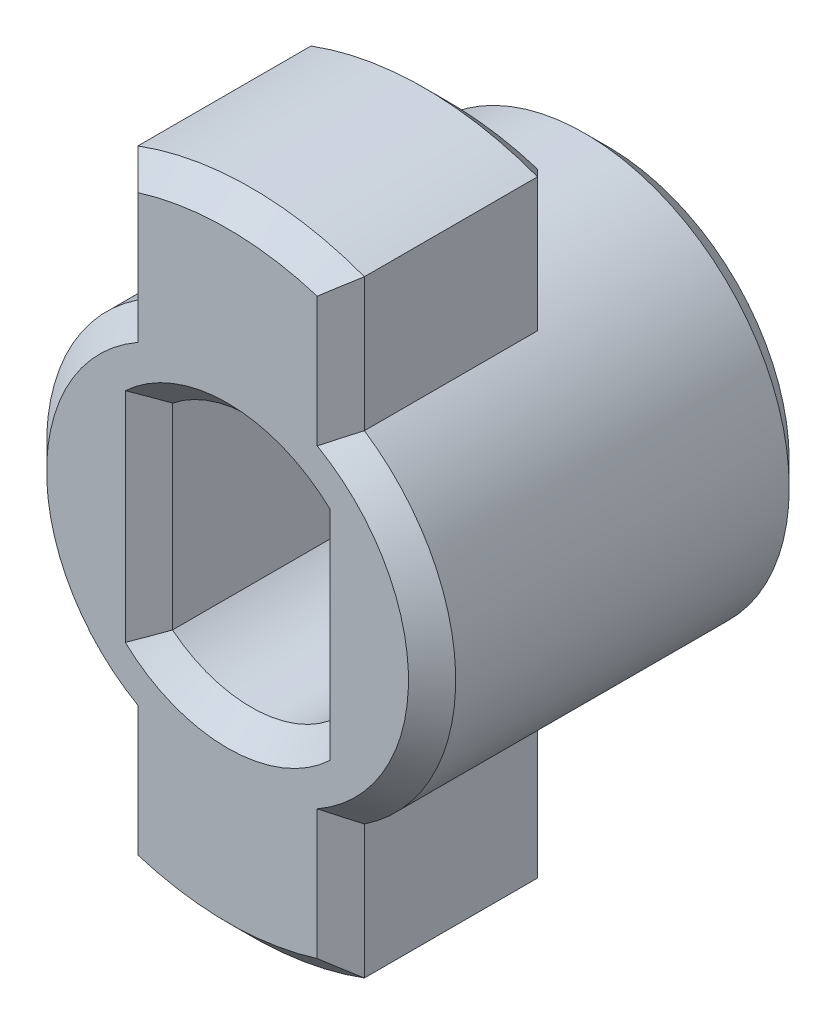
ISO-10303-21;
HEADER;
FILE_DESCRIPTION(('STEP AP214'),'2;1');
FILE_NAME('part.step','',(''),(''),'','','');
FILE_SCHEMA(('AUTOMOTIVE_DESIGN { 1 0 10303 214 1 1 1 1 }'));
ENDSEC;
DATA;
#1=APPLICATION_CONTEXT('core data for automotive mechanical design processes');
#2=APPLICATION_PROTOCOL_DEFINITION('international standard','automotive_design',2000,#1);
#3=PRODUCT_CONTEXT('',#1,'mechanical');
#4=PRODUCT('Part','Part','',(#3));
#5=PRODUCT_RELATED_PRODUCT_CATEGORY('part','',(#4));
#6=PRODUCT_DEFINITION_FORMATION('','',#4);
#7=PRODUCT_DEFINITION_CONTEXT('part definition',#1,'design');
#8=PRODUCT_DEFINITION('design','',#6,#7);
#9=PRODUCT_DEFINITION_SHAPE('','',#8);
#10=(LENGTH_UNIT() NAMED_UNIT(*) SI_UNIT(.MILLI.,.METRE.));
#11=(NAMED_UNIT(*) PLANE_ANGLE_UNIT() SI_UNIT($,.RADIAN.));
#12=(NAMED_UNIT(*) SI_UNIT($,.STERADIAN.) SOLID_ANGLE_UNIT());
#13=UNCERTAINTY_MEASURE_WITH_UNIT(LENGTH_MEASURE(1.E-05),#10,'distance_accuracy_value','');
#14=(GEOMETRIC_REPRESENTATION_CONTEXT(3) GLOBAL_UNCERTAINTY_ASSIGNED_CONTEXT((#13)) GLOBAL_UNIT_ASSIGNED_CONTEXT((#10,
#11,#12)) REPRESENTATION_CONTEXT('',''));
#15=CARTESIAN_POINT('',(0.,0.,0.));
#16=DIRECTION('',(0.,0.,1.));
#17=DIRECTION('',(1.,0.,0.));
#18=AXIS2_PLACEMENT_3D('',#15,#16,#17);
#19=CARTESIAN_POINT('',(0.,0.,12.1));
#20=DIRECTION('',(0.,0.,1.));
#21=DIRECTION('',(1.,0.,0.));
#22=AXIS2_PLACEMENT_3D('',#19,#20,#21);
#23=PLANE('',#22);
#24=DIRECTION('',(0.,-1.,0.));
#25=VECTOR('',#24,1.);
#26=CARTESIAN_POINT('',(3.25000000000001,0.,12.1));
#27=LINE('',#26,#25);
#28=CARTESIAN_POINT('',(3.25000000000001,3.46410161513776,12.1));
#29=VERTEX_POINT('',#28);
#30=CARTESIAN_POINT('',(3.25000000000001,-3.46410161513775,12.1));
#31=VERTEX_POINT('',#30);
#32=EDGE_CURVE('E264',#29,#31,#27,.T.);
#33=ORIENTED_EDGE('',*,*,#32,.T.);
#34=CARTESIAN_POINT('',(0.,0.,12.1));
#35=DIRECTION('',(0.,0.,1.));
#36=DIRECTION('',(1.,0.,0.));
#37=AXIS2_PLACEMENT_3D('',#34,#35,#36);
#38=CIRCLE('',#37,4.75000000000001);
#39=CARTESIAN_POINT('',(-3.25000000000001,-3.46410161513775,12.1));
#40=VERTEX_POINT('',#39);
#41=EDGE_CURVE('E266',#31,#40,#38,.F.);
#42=ORIENTED_EDGE('',*,*,#41,.T.);
#43=DIRECTION('',(0.,1.,0.));
#44=VECTOR('',#43,1.);
#45=CARTESIAN_POINT('',(-3.25000000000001,0.,12.1));
#46=LINE('',#45,#44);
#47=CARTESIAN_POINT('',(-3.25000000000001,3.46410161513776,12.1));
#48=VERTEX_POINT('',#47);
#49=EDGE_CURVE('E260',#40,#48,#46,.T.);
#50=ORIENTED_EDGE('',*,*,#49,.T.);
#51=CARTESIAN_POINT('',(0.,0.,12.1));
#52=DIRECTION('',(0.,0.,1.));
#53=DIRECTION('',(1.,0.,0.));
#54=AXIS2_PLACEMENT_3D('',#51,#52,#53);
#55=CIRCLE('',#54,4.75000000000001);
#56=EDGE_CURVE('E262',#48,#29,#55,.F.);
#57=ORIENTED_EDGE('',*,*,#56,.T.);
#58=EDGE_LOOP('',(#33,#42,#50,#57));
#59=FACE_BOUND('',#58,.T.);
#60=CARTESIAN_POINT('',(0.,0.,12.1));
#61=DIRECTION('',(0.,0.,1.));
#62=DIRECTION('',(1.,0.,0.));
#63=AXIS2_PLACEMENT_3D('',#60,#61,#62);
#64=CIRCLE('',#63,9.54999999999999);
#65=CARTESIAN_POINT('',(-2.84999999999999,-9.11482309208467,12.1));
#66=VERTEX_POINT('',#65);
#67=CARTESIAN_POINT('',(2.84999999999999,-9.11482309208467,12.1));
#68=VERTEX_POINT('',#67);
#69=EDGE_CURVE('E255',#66,#68,#64,.T.);
#70=ORIENTED_EDGE('',*,*,#69,.T.);
#71=DIRECTION('',(0.,1.,0.));
#72=VECTOR('',#71,1.);
#73=CARTESIAN_POINT('',(2.84999999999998,0.,12.1));
#74=LINE('',#73,#72);
#75=CARTESIAN_POINT('',(2.84999999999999,-4.9939963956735,12.1));
#76=VERTEX_POINT('',#75);
#77=EDGE_CURVE('E257',#68,#76,#74,.T.);
#78=ORIENTED_EDGE('',*,*,#77,.T.);
#79=CARTESIAN_POINT('',(0.,0.,12.1));
#80=DIRECTION('',(0.,0.,1.));
#81=DIRECTION('',(1.,0.,0.));
#82=AXIS2_PLACEMENT_3D('',#79,#80,#81);
#83=CIRCLE('',#82,5.74999999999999);
#84=CARTESIAN_POINT('',(2.84999999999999,4.9939963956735,12.1));
#85=VERTEX_POINT('',#84);
#86=EDGE_CURVE('E243',#76,#85,#83,.T.);
#87=ORIENTED_EDGE('',*,*,#86,.T.);
#88=DIRECTION('',(0.,1.,0.));
#89=VECTOR('',#88,1.);
#90=CARTESIAN_POINT('',(2.84999999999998,0.,12.1));
#91=LINE('',#90,#89);
#92=CARTESIAN_POINT('',(2.84999999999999,9.11482309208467,12.1));
#93=VERTEX_POINT('',#92);
#94=EDGE_CURVE('E245',#85,#93,#91,.T.);
#95=ORIENTED_EDGE('',*,*,#94,.T.);
#96=CARTESIAN_POINT('',(0.,0.,12.1));
#97=DIRECTION('',(0.,0.,1.));
#98=DIRECTION('',(1.,0.,0.));
#99=AXIS2_PLACEMENT_3D('',#96,#97,#98);
#100=CIRCLE('',#99,9.54999999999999);
#101=CARTESIAN_POINT('',(-2.84999999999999,9.11482309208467,12.1));
#102=VERTEX_POINT('',#101);
#103=EDGE_CURVE('E247',#93,#102,#100,.T.);
#104=ORIENTED_EDGE('',*,*,#103,.T.);
#105=DIRECTION('',(0.,-1.,0.));
#106=VECTOR('',#105,1.);
#107=CARTESIAN_POINT('',(-2.84999999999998,0.,12.1));
#108=LINE('',#107,#106);
#109=CARTESIAN_POINT('',(-2.84999999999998,4.9939963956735,12.1));
#110=VERTEX_POINT('',#109);
#111=EDGE_CURVE('E249',#102,#110,#108,.T.);
#112=ORIENTED_EDGE('',*,*,#111,.T.);
#113=CARTESIAN_POINT('',(0.,0.,12.1));
#114=DIRECTION('',(0.,0.,1.));
#115=DIRECTION('',(1.,0.,0.));
#116=AXIS2_PLACEMENT_3D('',#113,#114,#115);
#117=CIRCLE('',#116,5.74999999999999);
#118=CARTESIAN_POINT('',(-2.84999999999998,-4.9939963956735,12.1));
#119=VERTEX_POINT('',#118);
#120=EDGE_CURVE('E251',#110,#119,#117,.T.);
#121=ORIENTED_EDGE('',*,*,#120,.T.);
#122=DIRECTION('',(0.,-1.,0.));
#123=VECTOR('',#122,1.);
#124=CARTESIAN_POINT('',(-2.84999999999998,0.,12.1));
#125=LINE('',#124,#123);
#126=EDGE_CURVE('E253',#119,#66,#125,.T.);
#127=ORIENTED_EDGE('',*,*,#126,.T.);
#128=EDGE_LOOP('',(#70,#78,#87,#95,#104,#112,#121,#127));
#129=FACE_BOUND('',#128,.T.);
#130=ADVANCED_FACE('F29',(#59,#129),#23,.T.);
#131=CARTESIAN_POINT('',(0.,0.,0.));
#132=DIRECTION('',(0.,0.,1.));
#133=DIRECTION('',(1.,0.,0.));
#134=AXIS2_PLACEMENT_3D('',#131,#132,#133);
#135=PLANE('',#134);
#136=CARTESIAN_POINT('',(0.,0.,0.));
#137=DIRECTION('',(0.,0.,1.));
#138=DIRECTION('',(1.,0.,0.));
#139=AXIS2_PLACEMENT_3D('',#136,#137,#138);
#140=CIRCLE('',#139,4.75000000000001);
#141=CARTESIAN_POINT('',(-3.25000000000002,-3.46410161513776,0.));
#142=VERTEX_POINT('',#141);
#143=CARTESIAN_POINT('',(3.25000000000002,-3.46410161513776,0.));
#144=VERTEX_POINT('',#143);
#145=EDGE_CURVE('E214',#142,#144,#140,.T.);
#146=ORIENTED_EDGE('',*,*,#145,.T.);
#147=DIRECTION('',(0.,1.,0.));
#148=VECTOR('',#147,1.);
#149=CARTESIAN_POINT('',(3.25000000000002,3.1224989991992,0.));
#150=LINE('',#149,#148);
#151=CARTESIAN_POINT('',(3.25000000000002,3.46410161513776,0.));
#152=VERTEX_POINT('',#151);
#153=EDGE_CURVE('E193',#144,#152,#150,.T.);
#154=ORIENTED_EDGE('',*,*,#153,.T.);
#155=CARTESIAN_POINT('',(0.,0.,0.));
#156=DIRECTION('',(0.,0.,1.));
#157=DIRECTION('',(1.,0.,0.));
#158=AXIS2_PLACEMENT_3D('',#155,#156,#157);
#159=CIRCLE('',#158,4.75000000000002);
#160=CARTESIAN_POINT('',(-3.25000000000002,3.46410161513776,0.));
#161=VERTEX_POINT('',#160);
#162=EDGE_CURVE('E202',#152,#161,#159,.T.);
#163=ORIENTED_EDGE('',*,*,#162,.T.);
#164=DIRECTION('',(0.,-1.,0.));
#165=VECTOR('',#164,1.);
#166=CARTESIAN_POINT('',(-3.25000000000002,-3.1224989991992,0.));
#167=LINE('',#166,#165);
#168=EDGE_CURVE('E208',#161,#142,#167,.T.);
#169=ORIENTED_EDGE('',*,*,#168,.T.);
#170=EDGE_LOOP('',(#146,#154,#163,#169));
#171=FACE_BOUND('',#170,.T.);
#172=CARTESIAN_POINT('',(0.,0.,0.));
#173=DIRECTION('',(0.,0.,1.));
#174=DIRECTION('',(1.,0.,0.));
#175=AXIS2_PLACEMENT_3D('',#172,#173,#174);
#176=CIRCLE('',#175,5.75);
#177=CARTESIAN_POINT('',(5.75,0.,0.));
#178=VERTEX_POINT('',#177);
#179=EDGE_CURVE('E209',#178,#178,#176,.F.);
#180=ORIENTED_EDGE('',*,*,#179,.T.);
#181=EDGE_LOOP('',(#180));
#182=FACE_BOUND('',#181,.T.);
#183=ADVANCED_FACE('F211',(#171,#182),#135,.F.);
#184=CARTESIAN_POINT('',(0.,0.,12.1));
#185=DIRECTION('',(0.,0.,-1.));
#186=DIRECTION('',(-1.,0.,0.));
#187=AXIS2_PLACEMENT_3D('',#184,#185,#186);
#188=CYLINDRICAL_SURFACE('',#187,6.5);
#189=CARTESIAN_POINT('',(0.,0.,0.750000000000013));
#190=DIRECTION('',(0.,0.,1.));
#191=DIRECTION('',(1.,0.,0.));
#192=AXIS2_PLACEMENT_3D('',#189,#190,#191);
#193=CIRCLE('',#192,6.5);
#194=CARTESIAN_POINT('',(6.5,0.,0.750000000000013));
#195=VERTEX_POINT('',#194);
#196=EDGE_CURVE('E240',#195,#195,#193,.T.);
#197=ORIENTED_EDGE('',*,*,#196,.T.);
#198=EDGE_LOOP('',(#197));
#199=FACE_BOUND('',#198,.T.);
#200=DIRECTION('',(0.,0.,1.));
#201=VECTOR('',#200,1.);
#202=CARTESIAN_POINT('',(-3.6,-5.41202365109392,5.1));
#203=LINE('',#202,#201);
#204=CARTESIAN_POINT('',(-3.6,-5.41202365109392,5.85000000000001));
#205=VERTEX_POINT('',#204);
#206=CARTESIAN_POINT('',(-3.6,-5.41202365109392,11.35));
#207=VERTEX_POINT('',#206);
#208=EDGE_CURVE('E546',#205,#207,#203,.T.);
#209=ORIENTED_EDGE('',*,*,#208,.T.);
#210=CARTESIAN_POINT('',(0.,0.,11.35));
#211=DIRECTION('',(0.,0.,1.));
#212=DIRECTION('',(1.,0.,0.));
#213=AXIS2_PLACEMENT_3D('',#210,#211,#212);
#214=CIRCLE('',#213,6.5);
#215=CARTESIAN_POINT('',(-3.6,5.41202365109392,11.35));
#216=VERTEX_POINT('',#215);
#217=EDGE_CURVE('E238',#207,#216,#214,.F.);
#218=ORIENTED_EDGE('',*,*,#217,.T.);
#219=DIRECTION('',(0.,0.,1.));
#220=VECTOR('',#219,1.);
#221=CARTESIAN_POINT('',(-3.6,5.41202365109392,5.1));
#222=LINE('',#221,#220);
#223=CARTESIAN_POINT('',(-3.6,5.41202365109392,5.85000000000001));
#224=VERTEX_POINT('',#223);
#225=EDGE_CURVE('E316',#224,#216,#222,.T.);
#226=ORIENTED_EDGE('',*,*,#225,.F.);
#227=CARTESIAN_POINT('',(0.,0.,2.24999999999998));
#228=DIRECTION('',(-0.707106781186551,0.,-0.707106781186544));
#229=DIRECTION('',(0.707106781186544,0.,-0.707106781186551));
#230=AXIS2_PLACEMENT_3D('',#227,#228,#229);
#231=ELLIPSE('',#230,9.19238815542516,6.5);
#232=CARTESIAN_POINT('',(-2.84999999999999,5.84187469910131,5.1));
#233=VERTEX_POINT('',#232);
#234=EDGE_CURVE('E37',#224,#233,#231,.T.);
#235=ORIENTED_EDGE('',*,*,#234,.T.);
#236=CARTESIAN_POINT('',(0.,0.,5.1));
#237=DIRECTION('',(0.,0.,-1.));
#238=DIRECTION('',(1.,0.,0.));
#239=AXIS2_PLACEMENT_3D('',#236,#237,#238);
#240=CIRCLE('',#239,6.5);
#241=CARTESIAN_POINT('',(2.84999999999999,5.84187469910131,5.1));
#242=VERTEX_POINT('',#241);
#243=EDGE_CURVE('E313',#233,#242,#240,.T.);
#244=ORIENTED_EDGE('',*,*,#243,.T.);
#245=CARTESIAN_POINT('',(0.,0.,2.24999999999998));
#246=DIRECTION('',(0.707106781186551,0.,-0.707106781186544));
#247=DIRECTION('',(-0.707106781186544,0.,-0.707106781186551));
#248=AXIS2_PLACEMENT_3D('',#245,#246,#247);
#249=ELLIPSE('',#248,9.19238815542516,6.5);
#250=CARTESIAN_POINT('',(3.6,5.41202365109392,5.85000000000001));
#251=VERTEX_POINT('',#250);
#252=EDGE_CURVE('E11',#242,#251,#249,.T.);
#253=ORIENTED_EDGE('',*,*,#252,.T.);
#254=DIRECTION('',(0.,0.,1.));
#255=VECTOR('',#254,1.);
#256=CARTESIAN_POINT('',(3.6,5.41202365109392,5.1));
#257=LINE('',#256,#255);
#258=CARTESIAN_POINT('',(3.6,5.41202365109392,11.35));
#259=VERTEX_POINT('',#258);
#260=EDGE_CURVE('E533',#251,#259,#257,.T.);
#261=ORIENTED_EDGE('',*,*,#260,.T.);
#262=CARTESIAN_POINT('',(0.,0.,11.35));
#263=DIRECTION('',(0.,0.,1.));
#264=DIRECTION('',(1.,0.,0.));
#265=AXIS2_PLACEMENT_3D('',#262,#263,#264);
#266=CIRCLE('',#265,6.5);
#267=CARTESIAN_POINT('',(3.6,-5.41202365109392,11.35));
#268=VERTEX_POINT('',#267);
#269=EDGE_CURVE('E236',#259,#268,#266,.F.);
#270=ORIENTED_EDGE('',*,*,#269,.T.);
#271=DIRECTION('',(0.,0.,1.));
#272=VECTOR('',#271,1.);
#273=CARTESIAN_POINT('',(3.6,-5.41202365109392,5.1));
#274=LINE('',#273,#272);
#275=CARTESIAN_POINT('',(3.6,-5.41202365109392,5.85000000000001));
#276=VERTEX_POINT('',#275);
#277=EDGE_CURVE('E548',#276,#268,#274,.T.);
#278=ORIENTED_EDGE('',*,*,#277,.F.);
#279=CARTESIAN_POINT('',(0.,0.,2.24999999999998));
#280=DIRECTION('',(0.707106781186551,0.,-0.707106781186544));
#281=DIRECTION('',(-0.707106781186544,0.,-0.707106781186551));
#282=AXIS2_PLACEMENT_3D('',#279,#280,#281);
#283=ELLIPSE('',#282,9.19238815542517,6.5);
#284=CARTESIAN_POINT('',(2.85,-5.84187469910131,5.1));
#285=VERTEX_POINT('',#284);
#286=EDGE_CURVE('E306',#276,#285,#283,.T.);
#287=ORIENTED_EDGE('',*,*,#286,.T.);
#288=CARTESIAN_POINT('',(0.,0.,5.1));
#289=DIRECTION('',(0.,0.,-1.));
#290=DIRECTION('',(1.,0.,0.));
#291=AXIS2_PLACEMENT_3D('',#288,#289,#290);
#292=CIRCLE('',#291,6.5);
#293=CARTESIAN_POINT('',(-2.84999999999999,-5.84187469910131,5.1));
#294=VERTEX_POINT('',#293);
#295=EDGE_CURVE('E532',#285,#294,#292,.T.);
#296=ORIENTED_EDGE('',*,*,#295,.T.);
#297=CARTESIAN_POINT('',(0.,0.,2.24999999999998));
#298=DIRECTION('',(-0.707106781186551,0.,-0.707106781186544));
#299=DIRECTION('',(0.707106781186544,0.,-0.707106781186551));
#300=AXIS2_PLACEMENT_3D('',#297,#298,#299);
#301=ELLIPSE('',#300,9.19238815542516,6.5);
#302=EDGE_CURVE('E308',#294,#205,#301,.T.);
#303=ORIENTED_EDGE('',*,*,#302,.T.);
#304=EDGE_LOOP('',(#209,#218,#226,#235,#244,#253,#261,#270,#278,#287,#296,#303));
#305=FACE_BOUND('',#304,.T.);
#306=ADVANCED_FACE('F31',(#199,#305),#188,.T.);
#307=CARTESIAN_POINT('',(0.,0.,12.1));
#308=DIRECTION('',(0.,0.,-1.));
#309=DIRECTION('',(-1.,0.,0.));
#310=AXIS2_PLACEMENT_3D('',#307,#308,#309);
#311=CYLINDRICAL_SURFACE('',#310,4.);
#312=DIRECTION('',(0.,0.,-1.));
#313=VECTOR('',#312,1.);
#314=CARTESIAN_POINT('',(-2.5,3.12249899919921,12.1));
#315=LINE('',#314,#313);
#316=CARTESIAN_POINT('',(-2.5,3.12249899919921,11.35));
#317=VERTEX_POINT('',#316);
#318=CARTESIAN_POINT('',(-2.5,3.12249899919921,0.750000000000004));
#319=VERTEX_POINT('',#318);
#320=EDGE_CURVE('E561',#317,#319,#315,.T.);
#321=ORIENTED_EDGE('',*,*,#320,.T.);
#322=CARTESIAN_POINT('',(0.,0.,0.750000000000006));
#323=DIRECTION('',(0.,0.,1.));
#324=DIRECTION('',(1.,0.,0.));
#325=AXIS2_PLACEMENT_3D('',#322,#323,#324);
#326=CIRCLE('',#325,4.);
#327=CARTESIAN_POINT('',(2.5,3.1224989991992,0.750000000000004));
#328=VERTEX_POINT('',#327);
#329=EDGE_CURVE('E234',#319,#328,#326,.F.);
#330=ORIENTED_EDGE('',*,*,#329,.T.);
#331=DIRECTION('',(0.,0.,-1.));
#332=VECTOR('',#331,1.);
#333=CARTESIAN_POINT('',(2.5,3.1224989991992,12.1));
#334=LINE('',#333,#332);
#335=CARTESIAN_POINT('',(2.5,3.1224989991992,11.35));
#336=VERTEX_POINT('',#335);
#337=EDGE_CURVE('E545',#336,#328,#334,.T.);
#338=ORIENTED_EDGE('',*,*,#337,.F.);
#339=CARTESIAN_POINT('',(0.,0.,11.35));
#340=DIRECTION('',(0.,0.,1.));
#341=DIRECTION('',(1.,0.,0.));
#342=AXIS2_PLACEMENT_3D('',#339,#340,#341);
#343=CIRCLE('',#342,4.);
#344=EDGE_CURVE('E232',#336,#317,#343,.T.);
#345=ORIENTED_EDGE('',*,*,#344,.T.);
#346=EDGE_LOOP('',(#321,#330,#338,#345));
#347=FACE_BOUND('',#346,.T.);
#348=ADVANCED_FACE('F587',(#347),#311,.F.);
#349=CARTESIAN_POINT('',(-2.5,3.12249899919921,12.1));
#350=DIRECTION('',(1.,0.,0.));
#351=DIRECTION('',(0.,1.,0.));
#352=AXIS2_PLACEMENT_3D('',#349,#350,#351);
#353=PLANE('',#352);
#354=DIRECTION('',(0.,0.,-1.));
#355=VECTOR('',#354,1.);
#356=CARTESIAN_POINT('',(-2.5,-3.1224989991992,12.1));
#357=LINE('',#356,#355);
#358=CARTESIAN_POINT('',(-2.5,-3.1224989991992,11.35));
#359=VERTEX_POINT('',#358);
#360=CARTESIAN_POINT('',(-2.5,-3.1224989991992,0.750000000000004));
#361=VERTEX_POINT('',#360);
#362=EDGE_CURVE('E558',#359,#361,#357,.T.);
#363=ORIENTED_EDGE('',*,*,#362,.T.);
#364=DIRECTION('',(0.,1.,0.));
#365=VECTOR('',#364,1.);
#366=CARTESIAN_POINT('',(-2.5,3.12249899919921,0.750000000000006));
#367=LINE('',#366,#365);
#368=EDGE_CURVE('E230',#361,#319,#367,.T.);
#369=ORIENTED_EDGE('',*,*,#368,.T.);
#370=ORIENTED_EDGE('',*,*,#320,.F.);
#371=DIRECTION('',(0.,-1.,0.));
#372=VECTOR('',#371,1.);
#373=CARTESIAN_POINT('',(-2.5,3.12249899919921,11.35));
#374=LINE('',#373,#372);
#375=EDGE_CURVE('E228',#317,#359,#374,.T.);
#376=ORIENTED_EDGE('',*,*,#375,.T.);
#377=EDGE_LOOP('',(#363,#369,#370,#376));
#378=FACE_BOUND('',#377,.T.);
#379=ADVANCED_FACE('F595',(#378),#353,.T.);
#380=CARTESIAN_POINT('',(0.,0.,12.1));
#381=DIRECTION('',(0.,0.,-1.));
#382=DIRECTION('',(-1.,0.,0.));
#383=AXIS2_PLACEMENT_3D('',#380,#381,#382);
#384=CYLINDRICAL_SURFACE('',#383,4.);
#385=DIRECTION('',(0.,0.,-1.));
#386=VECTOR('',#385,1.);
#387=CARTESIAN_POINT('',(2.5,-3.1224989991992,12.1));
#388=LINE('',#387,#386);
#389=CARTESIAN_POINT('',(2.5,-3.1224989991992,11.35));
#390=VERTEX_POINT('',#389);
#391=CARTESIAN_POINT('',(2.5,-3.1224989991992,0.750000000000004));
#392=VERTEX_POINT('',#391);
#393=EDGE_CURVE('E555',#390,#392,#388,.T.);
#394=ORIENTED_EDGE('',*,*,#393,.T.);
#395=CARTESIAN_POINT('',(0.,0.,0.750000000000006));
#396=DIRECTION('',(0.,0.,1.));
#397=DIRECTION('',(1.,0.,0.));
#398=AXIS2_PLACEMENT_3D('',#395,#396,#397);
#399=CIRCLE('',#398,4.);
#400=EDGE_CURVE('E226',#392,#361,#399,.F.);
#401=ORIENTED_EDGE('',*,*,#400,.T.);
#402=ORIENTED_EDGE('',*,*,#362,.F.);
#403=CARTESIAN_POINT('',(0.,0.,11.35));
#404=DIRECTION('',(0.,0.,1.));
#405=DIRECTION('',(1.,0.,0.));
#406=AXIS2_PLACEMENT_3D('',#403,#404,#405);
#407=CIRCLE('',#406,4.);
#408=EDGE_CURVE('E223',#359,#390,#407,.T.);
#409=ORIENTED_EDGE('',*,*,#408,.T.);
#410=EDGE_LOOP('',(#394,#401,#402,#409));
#411=FACE_BOUND('',#410,.T.);
#412=ADVANCED_FACE('F575',(#411),#384,.F.);
#413=CARTESIAN_POINT('',(2.5,-3.1224989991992,12.1));
#414=DIRECTION('',(-1.,0.,0.));
#415=DIRECTION('',(0.,-1.,0.));
#416=AXIS2_PLACEMENT_3D('',#413,#414,#415);
#417=PLANE('',#416);
#418=ORIENTED_EDGE('',*,*,#337,.T.);
#419=DIRECTION('',(0.,-1.,0.));
#420=VECTOR('',#419,1.);
#421=CARTESIAN_POINT('',(2.5,-3.1224989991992,0.750000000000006));
#422=LINE('',#421,#420);
#423=EDGE_CURVE('E195',#328,#392,#422,.T.);
#424=ORIENTED_EDGE('',*,*,#423,.T.);
#425=ORIENTED_EDGE('',*,*,#393,.F.);
#426=DIRECTION('',(0.,1.,0.));
#427=VECTOR('',#426,1.);
#428=CARTESIAN_POINT('',(2.5,-3.1224989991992,11.35));
#429=LINE('',#428,#427);
#430=EDGE_CURVE('E216',#390,#336,#429,.T.);
#431=ORIENTED_EDGE('',*,*,#430,.T.);
#432=EDGE_LOOP('',(#418,#424,#425,#431));
#433=FACE_BOUND('',#432,.T.);
#434=ADVANCED_FACE('F573',(#433),#417,.T.);
#435=CARTESIAN_POINT('',(0.,0.,5.1));
#436=DIRECTION('',(0.,0.,1.));
#437=DIRECTION('',(1.,0.,0.));
#438=AXIS2_PLACEMENT_3D('',#435,#436,#437);
#439=CYLINDRICAL_SURFACE('',#438,10.3);
#440=DIRECTION('',(0.,0.,1.));
#441=VECTOR('',#440,1.);
#442=CARTESIAN_POINT('',(3.6,-9.65038859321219,5.1));
#443=LINE('',#442,#441);
#444=CARTESIAN_POINT('',(3.6,-9.65038859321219,5.85000000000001));
#445=VERTEX_POINT('',#444);
#446=CARTESIAN_POINT('',(3.6,-9.65038859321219,11.35));
#447=VERTEX_POINT('',#446);
#448=EDGE_CURVE('E541',#445,#447,#443,.T.);
#449=ORIENTED_EDGE('',*,*,#448,.T.);
#450=CARTESIAN_POINT('',(0.,0.,11.35));
#451=DIRECTION('',(0.,0.,1.));
#452=DIRECTION('',(1.,0.,0.));
#453=AXIS2_PLACEMENT_3D('',#450,#451,#452);
#454=CIRCLE('',#453,10.3);
#455=CARTESIAN_POINT('',(-3.6,-9.65038859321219,11.35));
#456=VERTEX_POINT('',#455);
#457=EDGE_CURVE('E277',#447,#456,#454,.F.);
#458=ORIENTED_EDGE('',*,*,#457,.T.);
#459=DIRECTION('',(0.,0.,1.));
#460=VECTOR('',#459,1.);
#461=CARTESIAN_POINT('',(-3.6,-9.65038859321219,5.1));
#462=LINE('',#461,#460);
#463=CARTESIAN_POINT('',(-3.6,-9.65038859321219,5.85000000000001));
#464=VERTEX_POINT('',#463);
#465=EDGE_CURVE('E542',#464,#456,#462,.T.);
#466=ORIENTED_EDGE('',*,*,#465,.F.);
#467=CARTESIAN_POINT('',(0.,0.,5.85000000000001));
#468=DIRECTION('',(0.,0.,1.));
#469=DIRECTION('',(1.,0.,0.));
#470=AXIS2_PLACEMENT_3D('',#467,#468,#469);
#471=CIRCLE('',#470,10.3);
#472=EDGE_CURVE('E275',#464,#445,#471,.T.);
#473=ORIENTED_EDGE('',*,*,#472,.T.);
#474=EDGE_LOOP('',(#449,#458,#466,#473));
#475=FACE_BOUND('',#474,.T.);
#476=ADVANCED_FACE('F653',(#475),#439,.T.);
#477=CARTESIAN_POINT('',(-3.6,-5.41202365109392,5.1));
#478=DIRECTION('',(-1.,0.,0.));
#479=DIRECTION('',(0.,-1.,0.));
#480=AXIS2_PLACEMENT_3D('',#477,#478,#479);
#481=PLANE('',#480);
#482=ORIENTED_EDGE('',*,*,#465,.T.);
#483=DIRECTION('',(0.,1.,0.));
#484=VECTOR('',#483,1.);
#485=CARTESIAN_POINT('',(-3.6,-5.41202365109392,11.35));
#486=LINE('',#485,#484);
#487=EDGE_CURVE('E281',#456,#207,#486,.T.);
#488=ORIENTED_EDGE('',*,*,#487,.T.);
#489=ORIENTED_EDGE('',*,*,#208,.F.);
#490=DIRECTION('',(0.,-1.,0.));
#491=VECTOR('',#490,1.);
#492=CARTESIAN_POINT('',(-3.6,-9.65038859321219,5.85000000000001));
#493=LINE('',#492,#491);
#494=EDGE_CURVE('E279',#205,#464,#493,.T.);
#495=ORIENTED_EDGE('',*,*,#494,.T.);
#496=EDGE_LOOP('',(#482,#488,#489,#495));
#497=FACE_BOUND('',#496,.T.);
#498=ADVANCED_FACE('F644',(#497),#481,.T.);
#499=CARTESIAN_POINT('',(3.6,-5.41202365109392,5.1));
#500=DIRECTION('',(1.,0.,0.));
#501=DIRECTION('',(0.,1.,0.));
#502=AXIS2_PLACEMENT_3D('',#499,#500,#501);
#503=PLANE('',#502);
#504=ORIENTED_EDGE('',*,*,#277,.T.);
#505=DIRECTION('',(0.,-1.,0.));
#506=VECTOR('',#505,1.);
#507=CARTESIAN_POINT('',(3.6,-5.41202365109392,11.35));
#508=LINE('',#507,#506);
#509=EDGE_CURVE('E272',#268,#447,#508,.T.);
#510=ORIENTED_EDGE('',*,*,#509,.T.);
#511=ORIENTED_EDGE('',*,*,#448,.F.);
#512=DIRECTION('',(0.,1.,0.));
#513=VECTOR('',#512,1.);
#514=CARTESIAN_POINT('',(3.6,-5.41202365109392,5.85000000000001));
#515=LINE('',#514,#513);
#516=EDGE_CURVE('E269',#445,#276,#515,.T.);
#517=ORIENTED_EDGE('',*,*,#516,.T.);
#518=EDGE_LOOP('',(#504,#510,#511,#517));
#519=FACE_BOUND('',#518,.T.);
#520=ADVANCED_FACE('F657',(#519),#503,.T.);
#521=CARTESIAN_POINT('',(0.,0.,5.1));
#522=DIRECTION('',(0.,0.,1.));
#523=DIRECTION('',(1.,0.,0.));
#524=AXIS2_PLACEMENT_3D('',#521,#522,#523);
#525=PLANE('',#524);
#526=ORIENTED_EDGE('',*,*,#295,.F.);
#527=DIRECTION('',(0.,-1.,0.));
#528=VECTOR('',#527,1.);
#529=CARTESIAN_POINT('',(2.85,-9.65038859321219,5.1));
#530=LINE('',#529,#528);
#531=CARTESIAN_POINT('',(2.85,-9.11482309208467,5.1));
#532=VERTEX_POINT('',#531);
#533=EDGE_CURVE('E300',#285,#532,#530,.T.);
#534=ORIENTED_EDGE('',*,*,#533,.T.);
#535=CARTESIAN_POINT('',(0.,0.,5.1));
#536=DIRECTION('',(0.,0.,1.));
#537=DIRECTION('',(1.,0.,0.));
#538=AXIS2_PLACEMENT_3D('',#535,#536,#537);
#539=CIRCLE('',#538,9.55);
#540=CARTESIAN_POINT('',(-2.84999999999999,-9.11482309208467,5.1));
#541=VERTEX_POINT('',#540);
#542=EDGE_CURVE('E298',#532,#541,#539,.F.);
#543=ORIENTED_EDGE('',*,*,#542,.T.);
#544=DIRECTION('',(0.,1.,0.));
#545=VECTOR('',#544,1.);
#546=CARTESIAN_POINT('',(-2.84999999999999,-5.41202365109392,5.1));
#547=LINE('',#546,#545);
#548=EDGE_CURVE('E296',#541,#294,#547,.T.);
#549=ORIENTED_EDGE('',*,*,#548,.T.);
#550=EDGE_LOOP('',(#526,#534,#543,#549));
#551=FACE_BOUND('',#550,.T.);
#552=ADVANCED_FACE('F665',(#551),#525,.F.);
#553=CARTESIAN_POINT('',(0.,0.,5.1));
#554=DIRECTION('',(0.,0.,1.));
#555=DIRECTION('',(1.,0.,0.));
#556=AXIS2_PLACEMENT_3D('',#553,#554,#555);
#557=CYLINDRICAL_SURFACE('',#556,10.3);
#558=DIRECTION('',(0.,0.,1.));
#559=VECTOR('',#558,1.);
#560=CARTESIAN_POINT('',(-3.6,9.65038859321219,5.1));
#561=LINE('',#560,#559);
#562=CARTESIAN_POINT('',(-3.6,9.65038859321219,5.85000000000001));
#563=VERTEX_POINT('',#562);
#564=CARTESIAN_POINT('',(-3.6,9.65038859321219,11.35));
#565=VERTEX_POINT('',#564);
#566=EDGE_CURVE('E320',#563,#565,#561,.T.);
#567=ORIENTED_EDGE('',*,*,#566,.T.);
#568=CARTESIAN_POINT('',(0.,0.,11.35));
#569=DIRECTION('',(0.,0.,1.));
#570=DIRECTION('',(1.,0.,0.));
#571=AXIS2_PLACEMENT_3D('',#568,#569,#570);
#572=CIRCLE('',#571,10.3);
#573=CARTESIAN_POINT('',(3.6,9.65038859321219,11.35));
#574=VERTEX_POINT('',#573);
#575=EDGE_CURVE('E290',#565,#574,#572,.F.);
#576=ORIENTED_EDGE('',*,*,#575,.T.);
#577=DIRECTION('',(0.,0.,1.));
#578=VECTOR('',#577,1.);
#579=CARTESIAN_POINT('',(3.6,9.65038859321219,5.1));
#580=LINE('',#579,#578);
#581=CARTESIAN_POINT('',(3.6,9.65038859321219,5.85000000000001));
#582=VERTEX_POINT('',#581);
#583=EDGE_CURVE('E529',#582,#574,#580,.T.);
#584=ORIENTED_EDGE('',*,*,#583,.F.);
#585=CARTESIAN_POINT('',(0.,0.,5.85000000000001));
#586=DIRECTION('',(0.,0.,1.));
#587=DIRECTION('',(1.,0.,0.));
#588=AXIS2_PLACEMENT_3D('',#585,#586,#587);
#589=CIRCLE('',#588,10.3);
#590=EDGE_CURVE('E288',#582,#563,#589,.T.);
#591=ORIENTED_EDGE('',*,*,#590,.T.);
#592=EDGE_LOOP('',(#567,#576,#584,#591));
#593=FACE_BOUND('',#592,.T.);
#594=ADVANCED_FACE('F667',(#593),#557,.T.);
#595=CARTESIAN_POINT('',(3.6,9.65038859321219,5.1));
#596=DIRECTION('',(1.,0.,0.));
#597=DIRECTION('',(0.,1.,0.));
#598=AXIS2_PLACEMENT_3D('',#595,#596,#597);
#599=PLANE('',#598);
#600=ORIENTED_EDGE('',*,*,#583,.T.);
#601=DIRECTION('',(0.,-1.,0.));
#602=VECTOR('',#601,1.);
#603=CARTESIAN_POINT('',(3.6,9.65038859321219,11.35));
#604=LINE('',#603,#602);
#605=EDGE_CURVE('E294',#574,#259,#604,.T.);
#606=ORIENTED_EDGE('',*,*,#605,.T.);
#607=ORIENTED_EDGE('',*,*,#260,.F.);
#608=DIRECTION('',(0.,1.,0.));
#609=VECTOR('',#608,1.);
#610=CARTESIAN_POINT('',(3.6,9.65038859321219,5.85000000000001));
#611=LINE('',#610,#609);
#612=EDGE_CURVE('E292',#251,#582,#611,.T.);
#613=ORIENTED_EDGE('',*,*,#612,.T.);
#614=EDGE_LOOP('',(#600,#606,#607,#613));
#615=FACE_BOUND('',#614,.T.);
#616=ADVANCED_FACE('F673',(#615),#599,.T.);
#617=CARTESIAN_POINT('',(-3.6,9.65038859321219,5.1));
#618=DIRECTION('',(-1.,0.,0.));
#619=DIRECTION('',(0.,-1.,0.));
#620=AXIS2_PLACEMENT_3D('',#617,#618,#619);
#621=PLANE('',#620);
#622=ORIENTED_EDGE('',*,*,#225,.T.);
#623=DIRECTION('',(0.,1.,0.));
#624=VECTOR('',#623,1.);
#625=CARTESIAN_POINT('',(-3.6,9.65038859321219,11.35));
#626=LINE('',#625,#624);
#627=EDGE_CURVE('E286',#216,#565,#626,.T.);
#628=ORIENTED_EDGE('',*,*,#627,.T.);
#629=ORIENTED_EDGE('',*,*,#566,.F.);
#630=DIRECTION('',(0.,-1.,0.));
#631=VECTOR('',#630,1.);
#632=CARTESIAN_POINT('',(-3.6,5.41202365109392,5.85000000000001));
#633=LINE('',#632,#631);
#634=EDGE_CURVE('E283',#563,#224,#633,.T.);
#635=ORIENTED_EDGE('',*,*,#634,.T.);
#636=EDGE_LOOP('',(#622,#628,#629,#635));
#637=FACE_BOUND('',#636,.T.);
#638=ADVANCED_FACE('F719',(#637),#621,.T.);
#639=CARTESIAN_POINT('',(0.,0.,5.1));
#640=DIRECTION('',(0.,0.,1.));
#641=DIRECTION('',(1.,0.,0.));
#642=AXIS2_PLACEMENT_3D('',#639,#640,#641);
#643=PLANE('',#642);
#644=ORIENTED_EDGE('',*,*,#243,.F.);
#645=DIRECTION('',(0.,1.,0.));
#646=VECTOR('',#645,1.);
#647=CARTESIAN_POINT('',(-2.85,9.65038859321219,5.1));
#648=LINE('',#647,#646);
#649=CARTESIAN_POINT('',(-2.84999999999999,9.11482309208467,5.1));
#650=VERTEX_POINT('',#649);
#651=EDGE_CURVE('E49',#233,#650,#648,.T.);
#652=ORIENTED_EDGE('',*,*,#651,.T.);
#653=CARTESIAN_POINT('',(0.,0.,5.1));
#654=DIRECTION('',(0.,0.,1.));
#655=DIRECTION('',(1.,0.,0.));
#656=AXIS2_PLACEMENT_3D('',#653,#654,#655);
#657=CIRCLE('',#656,9.55);
#658=CARTESIAN_POINT('',(2.85,9.11482309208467,5.1));
#659=VERTEX_POINT('',#658);
#660=EDGE_CURVE('E44',#650,#659,#657,.F.);
#661=ORIENTED_EDGE('',*,*,#660,.T.);
#662=DIRECTION('',(0.,-1.,0.));
#663=VECTOR('',#662,1.);
#664=CARTESIAN_POINT('',(2.84999999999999,5.41202365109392,5.1));
#665=LINE('',#664,#663);
#666=EDGE_CURVE('E303',#659,#242,#665,.T.);
#667=ORIENTED_EDGE('',*,*,#666,.T.);
#668=EDGE_LOOP('',(#644,#652,#661,#667));
#669=FACE_BOUND('',#668,.T.);
#670=ADVANCED_FACE('F319',(#669),#643,.F.);
#671=CARTESIAN_POINT('',(-3.25000000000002,0.,0.));
#672=DIRECTION('',(0.707106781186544,0.,-0.707106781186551));
#673=DIRECTION('',(-0.707106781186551,0.,-0.707106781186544));
#674=AXIS2_PLACEMENT_3D('',#671,#672,#673);
#675=PLANE('',#674);
#676=CARTESIAN_POINT('',(-2.5,3.12249899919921,0.750000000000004));
#677=CARTESIAN_POINT('',(-2.56217749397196,3.15236690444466,0.687822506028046));
#678=CARTESIAN_POINT('',(-2.62444643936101,3.18185258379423,0.625553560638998));
#679=CARTESIAN_POINT('',(-2.74914786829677,3.24010707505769,0.50085213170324));
#680=CARTESIAN_POINT('',(-2.81158034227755,3.26887592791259,0.43841965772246));
#681=CARTESIAN_POINT('',(-2.93659584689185,3.32574742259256,0.313404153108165));
#682=CARTESIAN_POINT('',(-2.99917887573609,3.35385007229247,0.25082112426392));
#683=CARTESIAN_POINT('',(-3.12448698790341,3.40943279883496,0.125513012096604));
#684=CARTESIAN_POINT('',(-3.18721207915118,3.43691283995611,0.062787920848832));
#685=CARTESIAN_POINT('',(-3.25000000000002,3.46410161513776,0.));
#686=B_SPLINE_CURVE_WITH_KNOTS('',3,(#676,#677,#678,#679,#680,#681,#682,#683,#684,#685),
.UNSPECIFIED.,.F.,.F.,(4,2,2,2,4),(0.,0.278597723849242,0.557179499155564,0.835757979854,
1.11435240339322),.UNSPECIFIED.);
#687=EDGE_CURVE('E205',#319,#161,#686,.T.);
#688=ORIENTED_EDGE('',*,*,#687,.F.);
#689=ORIENTED_EDGE('',*,*,#368,.F.);
#690=CARTESIAN_POINT('',(-2.5,-3.1224989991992,0.750000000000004));
#691=CARTESIAN_POINT('',(-2.56217749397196,-3.15236690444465,0.687822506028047));
#692=CARTESIAN_POINT('',(-2.62444643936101,-3.18185258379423,0.625553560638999));
#693=CARTESIAN_POINT('',(-2.74914786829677,-3.24010707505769,0.500852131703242));
#694=CARTESIAN_POINT('',(-2.81158034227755,-3.26887592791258,0.438419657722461));
#695=CARTESIAN_POINT('',(-2.93659584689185,-3.32574742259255,0.313404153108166));
#696=CARTESIAN_POINT('',(-2.99917887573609,-3.35385007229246,0.250821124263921));
#697=CARTESIAN_POINT('',(-3.12448698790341,-3.40943279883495,0.125513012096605));
#698=CARTESIAN_POINT('',(-3.18721207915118,-3.43691283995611,0.0627879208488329));
#699=CARTESIAN_POINT('',(-3.25000000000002,-3.46410161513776,0.));
#700=B_SPLINE_CURVE_WITH_KNOTS('',3,(#690,#691,#692,#693,#694,#695,#696,#697,#698,#699),
.UNSPECIFIED.,.F.,.F.,(4,2,2,2,4),(0.,0.278597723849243,0.557179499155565,0.835757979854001,
1.11435240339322),.UNSPECIFIED.);
#701=EDGE_CURVE('E321',#142,#361,#700,.F.);
#702=ORIENTED_EDGE('',*,*,#701,.F.);
#703=ORIENTED_EDGE('',*,*,#168,.F.);
#704=EDGE_LOOP('',(#688,#689,#702,#703));
#705=FACE_BOUND('',#704,.T.);
#706=ADVANCED_FACE('F519',(#705),#675,.T.);
#707=CARTESIAN_POINT('',(0.,0.,0.));
#708=DIRECTION('',(0.,0.,-1.));
#709=DIRECTION('',(-1.,0.,0.));
#710=AXIS2_PLACEMENT_3D('',#707,#708,#709);
#711=CONICAL_SURFACE('',#710,4.75000000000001,0.785398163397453);
#712=ORIENTED_EDGE('',*,*,#701,.T.);
#713=ORIENTED_EDGE('',*,*,#400,.F.);
#714=CARTESIAN_POINT('',(2.5,-3.1224989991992,0.750000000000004));
#715=CARTESIAN_POINT('',(2.56217749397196,-3.15236690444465,0.687822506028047));
#716=CARTESIAN_POINT('',(2.62444643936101,-3.18185258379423,0.625553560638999));
#717=CARTESIAN_POINT('',(2.74914786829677,-3.24010707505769,0.500852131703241));
#718=CARTESIAN_POINT('',(2.81158034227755,-3.26887592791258,0.438419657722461));
#719=CARTESIAN_POINT('',(2.93659584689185,-3.32574742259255,0.313404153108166));
#720=CARTESIAN_POINT('',(2.99917887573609,-3.35385007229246,0.25082112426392));
#721=CARTESIAN_POINT('',(3.12448698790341,-3.40943279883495,0.125513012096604));
#722=CARTESIAN_POINT('',(3.18721207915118,-3.43691283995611,0.062787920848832));
#723=CARTESIAN_POINT('',(3.25000000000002,-3.46410161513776,0.));
#724=B_SPLINE_CURVE_WITH_KNOTS('',3,(#714,#715,#716,#717,#718,#719,#720,#721,#722,#723),
.UNSPECIFIED.,.F.,.F.,(4,2,2,2,4),(0.,0.278597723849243,0.557179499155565,0.835757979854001,
1.11435240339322),.UNSPECIFIED.);
#725=EDGE_CURVE('E198',#144,#392,#724,.F.);
#726=ORIENTED_EDGE('',*,*,#725,.F.);
#727=ORIENTED_EDGE('',*,*,#145,.F.);
#728=EDGE_LOOP('',(#712,#713,#726,#727));
#729=FACE_BOUND('',#728,.T.);
#730=ADVANCED_FACE('F516',(#729),#711,.F.);
#731=CARTESIAN_POINT('',(0.,0.,0.));
#732=DIRECTION('',(0.,0.,-1.));
#733=DIRECTION('',(-1.,0.,0.));
#734=AXIS2_PLACEMENT_3D('',#731,#732,#733);
#735=CONICAL_SURFACE('',#734,4.75000000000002,0.785398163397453);
#736=ORIENTED_EDGE('',*,*,#687,.T.);
#737=ORIENTED_EDGE('',*,*,#162,.F.);
#738=CARTESIAN_POINT('',(3.25000000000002,3.46410161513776,0.));
#739=CARTESIAN_POINT('',(3.18721207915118,3.43691283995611,0.0627879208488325));
#740=CARTESIAN_POINT('',(3.12448698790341,3.40943279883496,0.125513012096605));
#741=CARTESIAN_POINT('',(2.99917887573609,3.35385007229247,0.250821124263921));
#742=CARTESIAN_POINT('',(2.93659584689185,3.32574742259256,0.313404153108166));
#743=CARTESIAN_POINT('',(2.81158034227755,3.26887592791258,0.438419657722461));
#744=CARTESIAN_POINT('',(2.74914786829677,3.24010707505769,0.500852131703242));
#745=CARTESIAN_POINT('',(2.62444643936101,3.18185258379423,0.625553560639));
#746=CARTESIAN_POINT('',(2.56217749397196,3.15236690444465,0.687822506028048));
#747=CARTESIAN_POINT('',(2.5,3.1224989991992,0.750000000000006));
#748=B_SPLINE_CURVE_WITH_KNOTS('',3,(#738,#739,#740,#741,#742,#743,#744,#745,#746,#747),
.UNSPECIFIED.,.F.,.F.,(4,2,2,2,4),(0.,0.278594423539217,0.557172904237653,0.835754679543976,
1.11435240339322),.UNSPECIFIED.);
#749=EDGE_CURVE('E189',#328,#152,#748,.F.);
#750=ORIENTED_EDGE('',*,*,#749,.F.);
#751=ORIENTED_EDGE('',*,*,#329,.F.);
#752=EDGE_LOOP('',(#736,#737,#750,#751));
#753=FACE_BOUND('',#752,.T.);
#754=ADVANCED_FACE('F203',(#753),#735,.F.);
#755=CARTESIAN_POINT('',(3.25000000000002,0.,0.));
#756=DIRECTION('',(-0.707106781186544,0.,-0.707106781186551));
#757=DIRECTION('',(-0.707106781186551,0.,0.707106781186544));
#758=AXIS2_PLACEMENT_3D('',#755,#756,#757);
#759=PLANE('',#758);
#760=ORIENTED_EDGE('',*,*,#725,.T.);
#761=ORIENTED_EDGE('',*,*,#423,.F.);
#762=ORIENTED_EDGE('',*,*,#749,.T.);
#763=ORIENTED_EDGE('',*,*,#153,.F.);
#764=EDGE_LOOP('',(#760,#761,#762,#763));
#765=FACE_BOUND('',#764,.T.);
#766=ADVANCED_FACE('F191',(#765),#759,.T.);
#767=CARTESIAN_POINT('',(0.,0.,0.750000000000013));
#768=DIRECTION('',(0.,0.,1.));
#769=DIRECTION('',(1.,0.,0.));
#770=AXIS2_PLACEMENT_3D('',#767,#768,#769);
#771=CONICAL_SURFACE('',#770,6.5,0.785398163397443);
#772=ORIENTED_EDGE('',*,*,#179,.F.);
#773=EDGE_LOOP('',(#772));
#774=FACE_BOUND('',#773,.T.);
#775=ORIENTED_EDGE('',*,*,#196,.F.);
#776=EDGE_LOOP('',(#775));
#777=FACE_BOUND('',#776,.T.);
#778=ADVANCED_FACE('F491',(#774,#777),#771,.T.);
#779=CARTESIAN_POINT('',(0.,0.,11.35));
#780=DIRECTION('',(0.,0.,1.));
#781=DIRECTION('',(1.,0.,0.));
#782=AXIS2_PLACEMENT_3D('',#779,#780,#781);
#783=CONICAL_SURFACE('',#782,4.,0.785398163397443);
#784=CARTESIAN_POINT('',(2.5,3.1224989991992,11.35));
#785=CARTESIAN_POINT('',(2.56217749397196,3.15236690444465,11.4121774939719));
#786=CARTESIAN_POINT('',(2.62444643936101,3.18185258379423,11.474446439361));
#787=CARTESIAN_POINT('',(2.74914786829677,3.24010707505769,11.5991478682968));
#788=CARTESIAN_POINT('',(2.81158034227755,3.26887592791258,11.6615803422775));
#789=CARTESIAN_POINT('',(2.93659584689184,3.32574742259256,11.7865958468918));
#790=CARTESIAN_POINT('',(2.99917887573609,3.35385007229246,11.8491788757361));
#791=CARTESIAN_POINT('',(3.1244869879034,3.40943279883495,11.9744869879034));
#792=CARTESIAN_POINT('',(3.18721207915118,3.43691283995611,12.0372120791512));
#793=CARTESIAN_POINT('',(3.25000000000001,3.46410161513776,12.1));
#794=B_SPLINE_CURVE_WITH_KNOTS('',3,(#784,#785,#786,#787,#788,#789,#790,#791,#792,#793),
.UNSPECIFIED.,.F.,.F.,(4,2,2,2,4),(0.,0.278597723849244,0.557179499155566,0.835757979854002,
1.11435240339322),.UNSPECIFIED.);
#795=EDGE_CURVE('E478',#29,#336,#794,.F.);
#796=ORIENTED_EDGE('',*,*,#795,.F.);
#797=ORIENTED_EDGE('',*,*,#56,.F.);
#798=CARTESIAN_POINT('',(-2.5,3.12249899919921,11.35));
#799=CARTESIAN_POINT('',(-2.56217749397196,3.15236690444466,11.4121774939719));
#800=CARTESIAN_POINT('',(-2.62444643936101,3.18185258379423,11.474446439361));
#801=CARTESIAN_POINT('',(-2.74914786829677,3.24010707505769,11.5991478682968));
#802=CARTESIAN_POINT('',(-2.81158034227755,3.26887592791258,11.6615803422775));
#803=CARTESIAN_POINT('',(-2.93659584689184,3.32574742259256,11.7865958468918));
#804=CARTESIAN_POINT('',(-2.99917887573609,3.35385007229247,11.8491788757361));
#805=CARTESIAN_POINT('',(-3.1244869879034,3.40943279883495,11.9744869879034));
#806=CARTESIAN_POINT('',(-3.18721207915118,3.43691283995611,12.0372120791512));
#807=CARTESIAN_POINT('',(-3.25000000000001,3.46410161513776,12.1));
#808=B_SPLINE_CURVE_WITH_KNOTS('',3,(#798,#799,#800,#801,#802,#803,#804,#805,#806,#807),
.UNSPECIFIED.,.F.,.F.,(4,2,2,2,4),(0.,0.278597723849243,0.557179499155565,0.835757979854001,
1.11435240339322),.UNSPECIFIED.);
#809=EDGE_CURVE('E199',#317,#48,#808,.T.);
#810=ORIENTED_EDGE('',*,*,#809,.F.);
#811=ORIENTED_EDGE('',*,*,#344,.F.);
#812=EDGE_LOOP('',(#796,#797,#810,#811));
#813=FACE_BOUND('',#812,.T.);
#814=ADVANCED_FACE('F487',(#813),#783,.F.);
#815=CARTESIAN_POINT('',(-2.5,3.12249899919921,11.35));
#816=DIRECTION('',(-0.707106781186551,0.,-0.707106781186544));
#817=DIRECTION('',(-0.707106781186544,0.,0.707106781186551));
#818=AXIS2_PLACEMENT_3D('',#815,#816,#817);
#819=PLANE('',#818);
#820=ORIENTED_EDGE('',*,*,#809,.T.);
#821=ORIENTED_EDGE('',*,*,#49,.F.);
#822=CARTESIAN_POINT('',(-3.25000000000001,-3.46410161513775,12.1));
#823=CARTESIAN_POINT('',(-3.18721207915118,-3.4369128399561,12.0372120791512));
#824=CARTESIAN_POINT('',(-3.1244869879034,-3.40943279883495,11.9744869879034));
#825=CARTESIAN_POINT('',(-2.99917887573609,-3.35385007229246,11.8491788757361));
#826=CARTESIAN_POINT('',(-2.93659584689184,-3.32574742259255,11.7865958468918));
#827=CARTESIAN_POINT('',(-2.81158034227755,-3.26887592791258,11.6615803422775));
#828=CARTESIAN_POINT('',(-2.74914786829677,-3.24010707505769,11.5991478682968));
#829=CARTESIAN_POINT('',(-2.62444643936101,-3.18185258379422,11.474446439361));
#830=CARTESIAN_POINT('',(-2.56217749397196,-3.15236690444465,11.4121774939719));
#831=CARTESIAN_POINT('',(-2.5,-3.1224989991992,11.35));
#832=B_SPLINE_CURVE_WITH_KNOTS('',3,(#822,#823,#824,#825,#826,#827,#828,#829,#830,#831),
.UNSPECIFIED.,.F.,.F.,(4,2,2,2,4),(0.,0.278594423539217,0.557172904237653,0.835754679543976,
1.11435240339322),.UNSPECIFIED.);
#833=EDGE_CURVE('E462',#359,#40,#832,.F.);
#834=ORIENTED_EDGE('',*,*,#833,.F.);
#835=ORIENTED_EDGE('',*,*,#375,.F.);
#836=EDGE_LOOP('',(#820,#821,#834,#835));
#837=FACE_BOUND('',#836,.T.);
#838=ADVANCED_FACE('F473',(#837),#819,.F.);
#839=CARTESIAN_POINT('',(2.5,-3.1224989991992,11.35));
#840=DIRECTION('',(0.707106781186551,0.,-0.707106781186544));
#841=DIRECTION('',(-0.707106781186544,0.,-0.707106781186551));
#842=AXIS2_PLACEMENT_3D('',#839,#840,#841);
#843=PLANE('',#842);
#844=ORIENTED_EDGE('',*,*,#795,.T.);
#845=ORIENTED_EDGE('',*,*,#430,.F.);
#846=CARTESIAN_POINT('',(2.5,-3.1224989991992,11.35));
#847=CARTESIAN_POINT('',(2.56217749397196,-3.15236690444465,11.4121774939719));
#848=CARTESIAN_POINT('',(2.62444643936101,-3.18185258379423,11.474446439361));
#849=CARTESIAN_POINT('',(2.74914786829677,-3.24010707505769,11.5991478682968));
#850=CARTESIAN_POINT('',(2.81158034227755,-3.26887592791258,11.6615803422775));
#851=CARTESIAN_POINT('',(2.93659584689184,-3.32574742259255,11.7865958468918));
#852=CARTESIAN_POINT('',(2.99917887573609,-3.35385007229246,11.8491788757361));
#853=CARTESIAN_POINT('',(3.1244869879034,-3.40943279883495,11.9744869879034));
#854=CARTESIAN_POINT('',(3.18721207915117,-3.4369128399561,12.0372120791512));
#855=CARTESIAN_POINT('',(3.25000000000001,-3.46410161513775,12.1));
#856=B_SPLINE_CURVE_WITH_KNOTS('',3,(#846,#847,#848,#849,#850,#851,#852,#853,#854,#855),
.UNSPECIFIED.,.F.,.F.,(4,2,2,2,4),(0.,0.278597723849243,0.557179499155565,0.835757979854,
1.11435240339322),.UNSPECIFIED.);
#857=EDGE_CURVE('E456',#31,#390,#856,.F.);
#858=ORIENTED_EDGE('',*,*,#857,.F.);
#859=ORIENTED_EDGE('',*,*,#32,.F.);
#860=EDGE_LOOP('',(#844,#845,#858,#859));
#861=FACE_BOUND('',#860,.T.);
#862=ADVANCED_FACE('F470',(#861),#843,.F.);
#863=CARTESIAN_POINT('',(0.,0.,11.35));
#864=DIRECTION('',(0.,0.,1.));
#865=DIRECTION('',(1.,0.,0.));
#866=AXIS2_PLACEMENT_3D('',#863,#864,#865);
#867=CONICAL_SURFACE('',#866,4.,0.785398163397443);
#868=ORIENTED_EDGE('',*,*,#833,.T.);
#869=ORIENTED_EDGE('',*,*,#41,.F.);
#870=ORIENTED_EDGE('',*,*,#857,.T.);
#871=ORIENTED_EDGE('',*,*,#408,.F.);
#872=EDGE_LOOP('',(#868,#869,#870,#871));
#873=FACE_BOUND('',#872,.T.);
#874=ADVANCED_FACE('F468',(#873),#867,.F.);
#875=CARTESIAN_POINT('',(-2.84999999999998,0.,12.1));
#876=DIRECTION('',(0.707106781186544,0.,-0.707106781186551));
#877=DIRECTION('',(-0.707106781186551,0.,-0.707106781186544));
#878=AXIS2_PLACEMENT_3D('',#875,#876,#877);
#879=PLANE('',#878);
#880=CARTESIAN_POINT('',(-3.6,9.65038859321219,11.35));
#881=CARTESIAN_POINT('',(-3.53714739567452,9.60675158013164,11.4128526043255));
#882=CARTESIAN_POINT('',(-3.4743774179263,9.56287630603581,11.4756225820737));
#883=CARTESIAN_POINT('',(-3.34901261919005,9.4746354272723,11.6009873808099));
#884=CARTESIAN_POINT('',(-3.28641779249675,9.43026983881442,11.6635822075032));
#885=CARTESIAN_POINT('',(-3.16140886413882,9.34103151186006,11.7885911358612));
#886=CARTESIAN_POINT('',(-3.09899476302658,9.29615877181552,11.8510052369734));
#887=CARTESIAN_POINT('',(-2.97435406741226,9.20588837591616,11.9756459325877));
#888=CARTESIAN_POINT('',(-2.91212747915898,9.16049070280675,12.037872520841));
#889=CARTESIAN_POINT('',(-2.84999999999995,9.11482309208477,12.1));
#890=B_SPLINE_CURVE_WITH_KNOTS('',3,(#880,#881,#882,#883,#884,#885,#886,#887,#888,#889),
.UNSPECIFIED.,.F.,.F.,(4,2,2,2,4),(0.,0.297061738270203,0.594113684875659,0.891166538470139,
1.1882291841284),.UNSPECIFIED.);
#891=EDGE_CURVE('E436',#565,#102,#890,.T.);
#892=ORIENTED_EDGE('',*,*,#891,.F.);
#893=ORIENTED_EDGE('',*,*,#627,.F.);
#894=CARTESIAN_POINT('',(-3.6,5.41202365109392,11.35));
#895=CARTESIAN_POINT('',(-3.53717626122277,5.37835949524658,11.4128237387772));
#896=CARTESIAN_POINT('',(-3.47442576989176,5.34442136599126,11.4755742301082));
#897=CARTESIAN_POINT('',(-3.34908506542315,5.27597060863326,11.6009149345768));
#898=CARTESIAN_POINT('',(-3.28649484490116,5.24145800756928,11.6635051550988));
#899=CARTESIAN_POINT('',(-3.16148213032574,5.17182835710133,11.7885178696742));
#900=CARTESIAN_POINT('',(-3.09905963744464,5.13671130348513,11.8509403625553));
#901=CARTESIAN_POINT('',(-2.97439251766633,5.0658396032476,11.9756074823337));
#902=CARTESIAN_POINT('',(-2.91214789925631,5.03008492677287,12.0378521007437));
#903=CARTESIAN_POINT('',(-2.84999999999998,4.9939963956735,12.1));
#904=B_SPLINE_CURVE_WITH_KNOTS('',3,(#894,#895,#896,#897,#898,#899,#900,#901,#902,#903),
.UNSPECIFIED.,.F.,.F.,(4,2,2,2,4),(0.,0.285030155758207,0.570046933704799,0.855065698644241,
1.1400978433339),.UNSPECIFIED.);
#905=EDGE_CURVE('E450',#110,#216,#904,.F.);
#906=ORIENTED_EDGE('',*,*,#905,.F.);
#907=ORIENTED_EDGE('',*,*,#111,.F.);
#908=EDGE_LOOP('',(#892,#893,#906,#907));
#909=FACE_BOUND('',#908,.T.);
#910=ADVANCED_FACE('F445',(#909),#879,.F.);
#911=CARTESIAN_POINT('',(0.,0.,12.1));
#912=DIRECTION('',(0.,0.,-1.));
#913=DIRECTION('',(-1.,0.,0.));
#914=AXIS2_PLACEMENT_3D('',#911,#912,#913);
#915=CONICAL_SURFACE('',#914,5.74999999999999,0.785398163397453);
#916=ORIENTED_EDGE('',*,*,#905,.T.);
#917=ORIENTED_EDGE('',*,*,#217,.F.);
#918=CARTESIAN_POINT('',(-3.6,-5.41202365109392,11.35));
#919=CARTESIAN_POINT('',(-3.53717626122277,-5.37835949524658,11.4128237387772));
#920=CARTESIAN_POINT('',(-3.47442576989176,-5.34442136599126,11.4755742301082));
#921=CARTESIAN_POINT('',(-3.34908506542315,-5.27597060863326,11.6009149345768));
#922=CARTESIAN_POINT('',(-3.28649484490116,-5.24145800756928,11.6635051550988));
#923=CARTESIAN_POINT('',(-3.16148213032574,-5.17182835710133,11.7885178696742));
#924=CARTESIAN_POINT('',(-3.09905963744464,-5.13671130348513,11.8509403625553));
#925=CARTESIAN_POINT('',(-2.97439251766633,-5.0658396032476,11.9756074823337));
#926=CARTESIAN_POINT('',(-2.91214789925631,-5.03008492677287,12.0378521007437));
#927=CARTESIAN_POINT('',(-2.84999999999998,-4.9939963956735,12.1));
#928=B_SPLINE_CURVE_WITH_KNOTS('',3,(#918,#919,#920,#921,#922,#923,#924,#925,#926,#927),
.UNSPECIFIED.,.F.,.F.,(4,2,2,2,4),(0.,0.285030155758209,0.570046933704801,0.855065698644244,
1.14009784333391),.UNSPECIFIED.);
#929=EDGE_CURVE('E430',#119,#207,#928,.F.);
#930=ORIENTED_EDGE('',*,*,#929,.F.);
#931=ORIENTED_EDGE('',*,*,#120,.F.);
#932=EDGE_LOOP('',(#916,#917,#930,#931));
#933=FACE_BOUND('',#932,.T.);
#934=ADVANCED_FACE('F442',(#933),#915,.T.);
#935=CARTESIAN_POINT('',(0.,0.,12.1));
#936=DIRECTION('',(0.,0.,-1.));
#937=DIRECTION('',(-1.,0.,0.));
#938=AXIS2_PLACEMENT_3D('',#935,#936,#937);
#939=CONICAL_SURFACE('',#938,9.54999999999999,0.785398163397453);
#940=ORIENTED_EDGE('',*,*,#891,.T.);
#941=ORIENTED_EDGE('',*,*,#103,.F.);
#942=CARTESIAN_POINT('',(3.6,9.65038859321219,11.35));
#943=CARTESIAN_POINT('',(3.53714739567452,9.60675158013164,11.4128526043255));
#944=CARTESIAN_POINT('',(3.4743774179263,9.56287630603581,11.4756225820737));
#945=CARTESIAN_POINT('',(3.34901261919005,9.4746354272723,11.6009873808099));
#946=CARTESIAN_POINT('',(3.28641779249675,9.43026983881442,11.6635822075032));
#947=CARTESIAN_POINT('',(3.16140886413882,9.34103151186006,11.7885911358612));
#948=CARTESIAN_POINT('',(3.09899476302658,9.29615877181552,11.8510052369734));
#949=CARTESIAN_POINT('',(2.97435406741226,9.20588837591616,11.9756459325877));
#950=CARTESIAN_POINT('',(2.91212747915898,9.16049070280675,12.037872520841));
#951=CARTESIAN_POINT('',(2.84999999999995,9.11482309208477,12.1));
#952=B_SPLINE_CURVE_WITH_KNOTS('',3,(#942,#943,#944,#945,#946,#947,#948,#949,#950,#951),
.UNSPECIFIED.,.F.,.F.,(4,2,2,2,4),(0.,0.297061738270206,0.59411368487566,0.891166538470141,
1.1882291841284),.UNSPECIFIED.);
#953=EDGE_CURVE('E416',#574,#93,#952,.T.);
#954=ORIENTED_EDGE('',*,*,#953,.F.);
#955=ORIENTED_EDGE('',*,*,#575,.F.);
#956=EDGE_LOOP('',(#940,#941,#954,#955));
#957=FACE_BOUND('',#956,.T.);
#958=ADVANCED_FACE('F425',(#957),#939,.T.);
#959=CARTESIAN_POINT('',(-2.84999999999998,0.,12.1));
#960=DIRECTION('',(0.707106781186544,0.,-0.707106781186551));
#961=DIRECTION('',(-0.707106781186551,0.,-0.707106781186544));
#962=AXIS2_PLACEMENT_3D('',#959,#960,#961);
#963=PLANE('',#962);
#964=ORIENTED_EDGE('',*,*,#929,.T.);
#965=ORIENTED_EDGE('',*,*,#487,.F.);
#966=CARTESIAN_POINT('',(-3.6,-9.65038859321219,11.35));
#967=CARTESIAN_POINT('',(-3.53714739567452,-9.60675158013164,11.4128526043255));
#968=CARTESIAN_POINT('',(-3.4743774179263,-9.56287630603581,11.4756225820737));
#969=CARTESIAN_POINT('',(-3.34901261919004,-9.4746354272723,11.6009873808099));
#970=CARTESIAN_POINT('',(-3.28641779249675,-9.43026983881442,11.6635822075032));
#971=CARTESIAN_POINT('',(-3.16140886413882,-9.34103151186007,11.7885911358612));
#972=CARTESIAN_POINT('',(-3.09899476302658,-9.29615877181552,11.8510052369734));
#973=CARTESIAN_POINT('',(-2.97435406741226,-9.20588837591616,11.9756459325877));
#974=CARTESIAN_POINT('',(-2.91212747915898,-9.16049070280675,12.037872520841));
#975=CARTESIAN_POINT('',(-2.84999999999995,-9.11482309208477,12.1));
#976=B_SPLINE_CURVE_WITH_KNOTS('',3,(#966,#967,#968,#969,#970,#971,#972,#973,#974,#975),
.UNSPECIFIED.,.F.,.F.,(4,2,2,2,4),(0.,0.297061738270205,0.59411368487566,0.891166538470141,
1.1882291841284),.UNSPECIFIED.);
#977=EDGE_CURVE('E410',#66,#456,#976,.F.);
#978=ORIENTED_EDGE('',*,*,#977,.F.);
#979=ORIENTED_EDGE('',*,*,#126,.F.);
#980=EDGE_LOOP('',(#964,#965,#978,#979));
#981=FACE_BOUND('',#980,.T.);
#982=ADVANCED_FACE('F422',(#981),#963,.F.);
#983=CARTESIAN_POINT('',(2.84999999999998,0.,12.1));
#984=DIRECTION('',(-0.707106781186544,0.,-0.707106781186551));
#985=DIRECTION('',(-0.707106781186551,0.,0.707106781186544));
#986=AXIS2_PLACEMENT_3D('',#983,#984,#985);
#987=PLANE('',#986);
#988=ORIENTED_EDGE('',*,*,#953,.T.);
#989=ORIENTED_EDGE('',*,*,#94,.F.);
#990=CARTESIAN_POINT('',(3.6,5.41202365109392,11.35));
#991=CARTESIAN_POINT('',(3.53717626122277,5.37835949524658,11.4128237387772));
#992=CARTESIAN_POINT('',(3.47442576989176,5.34442136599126,11.4755742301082));
#993=CARTESIAN_POINT('',(3.34908506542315,5.27597060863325,11.6009149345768));
#994=CARTESIAN_POINT('',(3.28649484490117,5.24145800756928,11.6635051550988));
#995=CARTESIAN_POINT('',(3.16148213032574,5.17182835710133,11.7885178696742));
#996=CARTESIAN_POINT('',(3.09905963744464,5.13671130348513,11.8509403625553));
#997=CARTESIAN_POINT('',(2.97439251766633,5.0658396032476,11.9756074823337));
#998=CARTESIAN_POINT('',(2.91214789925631,5.03008492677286,12.0378521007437));
#999=CARTESIAN_POINT('',(2.84999999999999,4.9939963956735,12.1));
#1000=B_SPLINE_CURVE_WITH_KNOTS('',3,(#990,#991,#992,#993,#994,#995,#996,#997,#998,#999),
.UNSPECIFIED.,.F.,.F.,(4,2,2,2,4),(0.,0.285030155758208,0.5700469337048,0.855065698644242,
1.14009784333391),.UNSPECIFIED.);
#1001=EDGE_CURVE('E396',#259,#85,#1000,.T.);
#1002=ORIENTED_EDGE('',*,*,#1001,.F.);
#1003=ORIENTED_EDGE('',*,*,#605,.F.);
#1004=EDGE_LOOP('',(#988,#989,#1002,#1003));
#1005=FACE_BOUND('',#1004,.T.);
#1006=ADVANCED_FACE('F405',(#1005),#987,.F.);
#1007=CARTESIAN_POINT('',(0.,0.,12.1));
#1008=DIRECTION('',(0.,0.,-1.));
#1009=DIRECTION('',(-1.,0.,0.));
#1010=AXIS2_PLACEMENT_3D('',#1007,#1008,#1009);
#1011=CONICAL_SURFACE('',#1010,9.54999999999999,0.785398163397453);
#1012=ORIENTED_EDGE('',*,*,#977,.T.);
#1013=ORIENTED_EDGE('',*,*,#457,.F.);
#1014=CARTESIAN_POINT('',(3.6,-9.65038859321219,11.35));
#1015=CARTESIAN_POINT('',(3.53714739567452,-9.60675158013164,11.4128526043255));
#1016=CARTESIAN_POINT('',(3.4743774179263,-9.56287630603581,11.4756225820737));
#1017=CARTESIAN_POINT('',(3.34901261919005,-9.4746354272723,11.6009873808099));
#1018=CARTESIAN_POINT('',(3.28641779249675,-9.43026983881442,11.6635822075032));
#1019=CARTESIAN_POINT('',(3.16140886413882,-9.34103151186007,11.7885911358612));
#1020=CARTESIAN_POINT('',(3.09899476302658,-9.29615877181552,11.8510052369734));
#1021=CARTESIAN_POINT('',(2.97435406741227,-9.20588837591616,11.9756459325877));
#1022=CARTESIAN_POINT('',(2.91212747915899,-9.16049070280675,12.037872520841));
#1023=CARTESIAN_POINT('',(2.84999999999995,-9.11482309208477,12.1));
#1024=B_SPLINE_CURVE_WITH_KNOTS('',3,(#1014,#1015,#1016,#1017,#1018,#1019,#1020,#1021,#1022,
#1023),.UNSPECIFIED.,.F.,.F.,(4,2,2,2,4),(0.,0.297061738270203,0.594113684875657,
0.891166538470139,1.18822918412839),.UNSPECIFIED.);
#1025=EDGE_CURVE('E391',#68,#447,#1024,.F.);
#1026=ORIENTED_EDGE('',*,*,#1025,.F.);
#1027=ORIENTED_EDGE('',*,*,#69,.F.);
#1028=EDGE_LOOP('',(#1012,#1013,#1026,#1027));
#1029=FACE_BOUND('',#1028,.T.);
#1030=ADVANCED_FACE('F402',(#1029),#1011,.T.);
#1031=CARTESIAN_POINT('',(0.,0.,12.1));
#1032=DIRECTION('',(0.,0.,-1.));
#1033=DIRECTION('',(-1.,0.,0.));
#1034=AXIS2_PLACEMENT_3D('',#1031,#1032,#1033);
#1035=CONICAL_SURFACE('',#1034,5.74999999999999,0.785398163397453);
#1036=ORIENTED_EDGE('',*,*,#1001,.T.);
#1037=ORIENTED_EDGE('',*,*,#86,.F.);
#1038=CARTESIAN_POINT('',(2.84999999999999,-4.9939963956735,12.1));
#1039=CARTESIAN_POINT('',(2.91214789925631,-5.03008492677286,12.0378521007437));
#1040=CARTESIAN_POINT('',(2.97439251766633,-5.0658396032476,11.9756074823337));
#1041=CARTESIAN_POINT('',(3.09905963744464,-5.13671130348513,11.8509403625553));
#1042=CARTESIAN_POINT('',(3.16148213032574,-5.17182835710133,11.7885178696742));
#1043=CARTESIAN_POINT('',(3.28649484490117,-5.24145800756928,11.6635051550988));
#1044=CARTESIAN_POINT('',(3.34908506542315,-5.27597060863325,11.6009149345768));
#1045=CARTESIAN_POINT('',(3.47442576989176,-5.34442136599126,11.4755742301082));
#1046=CARTESIAN_POINT('',(3.53717626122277,-5.37835949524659,11.4128237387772));
#1047=CARTESIAN_POINT('',(3.6,-5.41202365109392,11.35));
#1048=B_SPLINE_CURVE_WITH_KNOTS('',3,(#1038,#1039,#1040,#1041,#1042,#1043,#1044,#1045,#1046,
#1047),.UNSPECIFIED.,.F.,.F.,(4,2,2,2,4),(0.,0.285032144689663,0.570050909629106,
0.855067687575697,1.1400978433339),.UNSPECIFIED.);
#1049=EDGE_CURVE('E373',#268,#76,#1048,.F.);
#1050=ORIENTED_EDGE('',*,*,#1049,.F.);
#1051=ORIENTED_EDGE('',*,*,#269,.F.);
#1052=EDGE_LOOP('',(#1036,#1037,#1050,#1051));
#1053=FACE_BOUND('',#1052,.T.);
#1054=ADVANCED_FACE('F386',(#1053),#1035,.T.);
#1055=CARTESIAN_POINT('',(2.84999999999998,0.,12.1));
#1056=DIRECTION('',(-0.707106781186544,0.,-0.707106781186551));
#1057=DIRECTION('',(-0.707106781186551,0.,0.707106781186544));
#1058=AXIS2_PLACEMENT_3D('',#1055,#1056,#1057);
#1059=PLANE('',#1058);
#1060=ORIENTED_EDGE('',*,*,#1025,.T.);
#1061=ORIENTED_EDGE('',*,*,#509,.F.);
#1062=ORIENTED_EDGE('',*,*,#1049,.T.);
#1063=ORIENTED_EDGE('',*,*,#77,.F.);
#1064=EDGE_LOOP('',(#1060,#1061,#1062,#1063));
#1065=FACE_BOUND('',#1064,.T.);
#1066=ADVANCED_FACE('F382',(#1065),#1059,.F.);
#1067=CARTESIAN_POINT('',(-3.6,-5.41202365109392,5.85000000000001));
#1068=DIRECTION('',(-0.707106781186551,0.,-0.707106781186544));
#1069=DIRECTION('',(-0.707106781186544,0.,0.707106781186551));
#1070=AXIS2_PLACEMENT_3D('',#1067,#1068,#1069);
#1071=PLANE('',#1070);
#1072=ORIENTED_EDGE('',*,*,#302,.F.);
#1073=ORIENTED_EDGE('',*,*,#548,.F.);
#1074=CARTESIAN_POINT('',(-2.84999999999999,-9.11482309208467,5.1));
#1075=CARTESIAN_POINT('',(-2.912127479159,-9.16049070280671,5.16212747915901));
#1076=CARTESIAN_POINT('',(-2.97435406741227,-9.20588837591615,5.22435406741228));
#1077=CARTESIAN_POINT('',(-3.09899476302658,-9.29615877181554,5.34899476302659));
#1078=CARTESIAN_POINT('',(-3.16140886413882,-9.34103151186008,5.41140886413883));
#1079=CARTESIAN_POINT('',(-3.28641779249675,-9.43026983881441,5.53641779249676));
#1080=CARTESIAN_POINT('',(-3.34901261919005,-9.47463542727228,5.59901261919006));
#1081=CARTESIAN_POINT('',(-3.47437741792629,-9.56287630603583,5.7243774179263));
#1082=CARTESIAN_POINT('',(-3.53714739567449,-9.60675158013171,5.78714739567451));
#1083=CARTESIAN_POINT('',(-3.59999999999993,-9.65038859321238,5.84999999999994));
#1084=B_SPLINE_CURVE_WITH_KNOTS('',3,(#1074,#1075,#1076,#1077,#1078,#1079,#1080,#1081,#1082,
#1083),.UNSPECIFIED.,.F.,.F.,(4,2,2,2,4),(0.,0.297062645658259,0.594115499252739,
0.891167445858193,1.1882291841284),.UNSPECIFIED.);
#1085=EDGE_CURVE('E367',#464,#541,#1084,.F.);
#1086=ORIENTED_EDGE('',*,*,#1085,.F.);
#1087=ORIENTED_EDGE('',*,*,#494,.F.);
#1088=EDGE_LOOP('',(#1072,#1073,#1086,#1087));
#1089=FACE_BOUND('',#1088,.T.);
#1090=ADVANCED_FACE('F358',(#1089),#1071,.T.);
#1091=CARTESIAN_POINT('',(0.,0.,5.85000000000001));
#1092=DIRECTION('',(0.,0.,1.));
#1093=DIRECTION('',(1.,0.,0.));
#1094=AXIS2_PLACEMENT_3D('',#1091,#1092,#1093);
#1095=CONICAL_SURFACE('',#1094,10.3,0.785398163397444);
#1096=ORIENTED_EDGE('',*,*,#1085,.T.);
#1097=ORIENTED_EDGE('',*,*,#542,.F.);
#1098=CARTESIAN_POINT('',(2.85,-9.11482309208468,5.1));
#1099=CARTESIAN_POINT('',(2.91212747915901,-9.16049070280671,5.16212747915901));
#1100=CARTESIAN_POINT('',(2.97435406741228,-9.20588837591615,5.22435406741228));
#1101=CARTESIAN_POINT('',(3.09899476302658,-9.29615877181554,5.34899476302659));
#1102=CARTESIAN_POINT('',(3.16140886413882,-9.34103151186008,5.41140886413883));
#1103=CARTESIAN_POINT('',(3.28641779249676,-9.43026983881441,5.53641779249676));
#1104=CARTESIAN_POINT('',(3.34901261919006,-9.47463542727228,5.59901261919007));
#1105=CARTESIAN_POINT('',(3.47437741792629,-9.56287630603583,5.7243774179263));
#1106=CARTESIAN_POINT('',(3.5371473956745,-9.60675158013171,5.78714739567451));
#1107=CARTESIAN_POINT('',(3.59999999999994,-9.65038859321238,5.84999999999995));
#1108=B_SPLINE_CURVE_WITH_KNOTS('',3,(#1098,#1099,#1100,#1101,#1102,#1103,#1104,#1105,#1106,
#1107),.UNSPECIFIED.,.F.,.F.,(4,2,2,2,4),(0.,0.297062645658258,0.594115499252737,
0.891167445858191,1.18822918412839),.UNSPECIFIED.);
#1109=EDGE_CURVE('E332',#445,#532,#1108,.F.);
#1110=ORIENTED_EDGE('',*,*,#1109,.F.);
#1111=ORIENTED_EDGE('',*,*,#472,.F.);
#1112=EDGE_LOOP('',(#1096,#1097,#1110,#1111));
#1113=FACE_BOUND('',#1112,.T.);
#1114=ADVANCED_FACE('F354',(#1113),#1095,.T.);
#1115=CARTESIAN_POINT('',(3.6,-5.41202365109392,5.85000000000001));
#1116=DIRECTION('',(0.707106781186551,0.,-0.707106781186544));
#1117=DIRECTION('',(-0.707106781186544,0.,-0.707106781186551));
#1118=AXIS2_PLACEMENT_3D('',#1115,#1116,#1117);
#1119=PLANE('',#1118);
#1120=ORIENTED_EDGE('',*,*,#1109,.T.);
#1121=ORIENTED_EDGE('',*,*,#533,.F.);
#1122=ORIENTED_EDGE('',*,*,#286,.F.);
#1123=ORIENTED_EDGE('',*,*,#516,.F.);
#1124=EDGE_LOOP('',(#1120,#1121,#1122,#1123));
#1125=FACE_BOUND('',#1124,.T.);
#1126=ADVANCED_FACE('F352',(#1125),#1119,.T.);
#1127=CARTESIAN_POINT('',(3.6,9.65038859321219,5.85000000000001));
#1128=DIRECTION('',(0.707106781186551,0.,-0.707106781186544));
#1129=DIRECTION('',(-0.707106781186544,0.,-0.707106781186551));
#1130=AXIS2_PLACEMENT_3D('',#1127,#1128,#1129);
#1131=PLANE('',#1130);
#1132=ORIENTED_EDGE('',*,*,#252,.F.);
#1133=ORIENTED_EDGE('',*,*,#666,.F.);
#1134=CARTESIAN_POINT('',(3.6,9.65038859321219,5.85000000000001));
#1135=CARTESIAN_POINT('',(3.53714739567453,9.60675158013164,5.78714739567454));
#1136=CARTESIAN_POINT('',(3.4743774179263,9.56287630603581,5.72437741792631));
#1137=CARTESIAN_POINT('',(3.34901261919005,9.4746354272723,5.59901261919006));
#1138=CARTESIAN_POINT('',(3.28641779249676,9.43026983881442,5.53641779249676));
#1139=CARTESIAN_POINT('',(3.16140886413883,9.34103151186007,5.41140886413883));
#1140=CARTESIAN_POINT('',(3.09899476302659,9.29615877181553,5.34899476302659));
#1141=CARTESIAN_POINT('',(2.97435406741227,9.20588837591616,5.22435406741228));
#1142=CARTESIAN_POINT('',(2.91212747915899,9.16049070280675,5.162127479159));
#1143=CARTESIAN_POINT('',(2.84999999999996,9.11482309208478,5.09999999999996));
#1144=B_SPLINE_CURVE_WITH_KNOTS('',3,(#1134,#1135,#1136,#1137,#1138,#1139,#1140,#1141,#1142,
#1143),.UNSPECIFIED.,.F.,.F.,(4,2,2,2,4),(0.,0.297061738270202,0.594113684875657,
0.891166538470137,1.18822918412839),.UNSPECIFIED.);
#1145=EDGE_CURVE('E329',#582,#659,#1144,.T.);
#1146=ORIENTED_EDGE('',*,*,#1145,.F.);
#1147=ORIENTED_EDGE('',*,*,#612,.F.);
#1148=EDGE_LOOP('',(#1132,#1133,#1146,#1147));
#1149=FACE_BOUND('',#1148,.T.);
#1150=ADVANCED_FACE('F348',(#1149),#1131,.T.);
#1151=CARTESIAN_POINT('',(0.,0.,5.85000000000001));
#1152=DIRECTION('',(0.,0.,1.));
#1153=DIRECTION('',(1.,0.,0.));
#1154=AXIS2_PLACEMENT_3D('',#1151,#1152,#1153);
#1155=CONICAL_SURFACE('',#1154,10.3,0.785398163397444);
#1156=ORIENTED_EDGE('',*,*,#1145,.T.);
#1157=ORIENTED_EDGE('',*,*,#660,.F.);
#1158=CARTESIAN_POINT('',(-2.85,9.11482309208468,5.1));
#1159=CARTESIAN_POINT('',(-2.912127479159,9.16049070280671,5.16212747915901));
#1160=CARTESIAN_POINT('',(-2.97435406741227,9.20588837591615,5.22435406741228));
#1161=CARTESIAN_POINT('',(-3.09899476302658,9.29615877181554,5.34899476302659));
#1162=CARTESIAN_POINT('',(-3.16140886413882,9.34103151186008,5.41140886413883));
#1163=CARTESIAN_POINT('',(-3.28641779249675,9.43026983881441,5.53641779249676));
#1164=CARTESIAN_POINT('',(-3.34901261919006,9.47463542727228,5.59901261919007));
#1165=CARTESIAN_POINT('',(-3.47437741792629,9.56287630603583,5.7243774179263));
#1166=CARTESIAN_POINT('',(-3.5371473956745,9.60675158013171,5.78714739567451));
#1167=CARTESIAN_POINT('',(-3.59999999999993,9.65038859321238,5.84999999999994));
#1168=B_SPLINE_CURVE_WITH_KNOTS('',3,(#1158,#1159,#1160,#1161,#1162,#1163,#1164,#1165,#1166,
#1167),.UNSPECIFIED.,.F.,.F.,(4,2,2,2,4),(0.,0.297062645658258,0.594115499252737,
0.891167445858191,1.18822918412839),.UNSPECIFIED.);
#1169=EDGE_CURVE('E326',#563,#650,#1168,.F.);
#1170=ORIENTED_EDGE('',*,*,#1169,.F.);
#1171=ORIENTED_EDGE('',*,*,#590,.F.);
#1172=EDGE_LOOP('',(#1156,#1157,#1170,#1171));
#1173=FACE_BOUND('',#1172,.T.);
#1174=ADVANCED_FACE('F344',(#1173),#1155,.T.);
#1175=CARTESIAN_POINT('',(-3.6,9.65038859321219,5.85000000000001));
#1176=DIRECTION('',(-0.707106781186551,0.,-0.707106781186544));
#1177=DIRECTION('',(-0.707106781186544,0.,0.707106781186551));
#1178=AXIS2_PLACEMENT_3D('',#1175,#1176,#1177);
#1179=PLANE('',#1178);
#1180=ORIENTED_EDGE('',*,*,#1169,.T.);
#1181=ORIENTED_EDGE('',*,*,#651,.F.);
#1182=ORIENTED_EDGE('',*,*,#234,.F.);
#1183=ORIENTED_EDGE('',*,*,#634,.F.);
#1184=EDGE_LOOP('',(#1180,#1181,#1182,#1183));
#1185=FACE_BOUND('',#1184,.T.);
#1186=ADVANCED_FACE('F324',(#1185),#1179,.T.);
#1187=CLOSED_SHELL('',(#130,#183,#306,#348,#379,#412,#434,#476,#498,#520,#552,#594,#616,#638,
#670,#706,#730,#754,#766,#778,#814,#838,#862,#874,#910,#934,#958,#982,#1006,#1030,#1054,#1066,
#1090,#1114,#1126,#1150,#1174,#1186));
#1188=MANIFOLD_SOLID_BREP('B2',#1187);
#1189=ADVANCED_BREP_SHAPE_REPRESENTATION('',(#18,#1188),#14);
#1190=SHAPE_DEFINITION_REPRESENTATION(#9,#1189);
ENDSEC;
END-ISO-10303-21;
